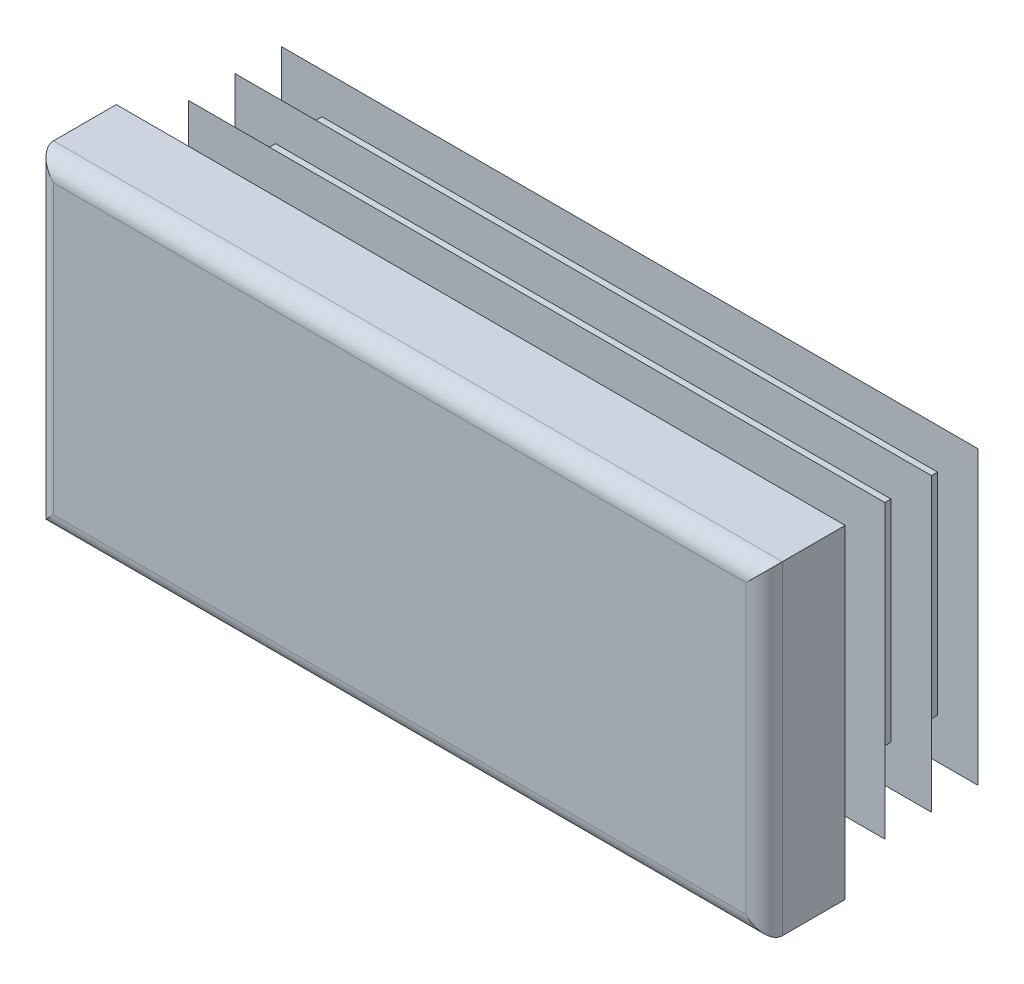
ISO-10303-21;
HEADER;
FILE_DESCRIPTION(('STEP AP214'),'2;1');
FILE_NAME('part.step','',(''),(''),'','','');
FILE_SCHEMA(('AUTOMOTIVE_DESIGN { 1 0 10303 214 1 1 1 1 }'));
ENDSEC;
DATA;
#1=APPLICATION_CONTEXT('core data for automotive mechanical design processes');
#2=APPLICATION_PROTOCOL_DEFINITION('international standard','automotive_design',2000,#1);
#3=PRODUCT_CONTEXT('',#1,'mechanical');
#4=PRODUCT('Part','Part','',(#3));
#5=PRODUCT_RELATED_PRODUCT_CATEGORY('part','',(#4));
#6=PRODUCT_DEFINITION_FORMATION('','',#4);
#7=PRODUCT_DEFINITION_CONTEXT('part definition',#1,'design');
#8=PRODUCT_DEFINITION('design','',#6,#7);
#9=PRODUCT_DEFINITION_SHAPE('','',#8);
#10=(LENGTH_UNIT() NAMED_UNIT(*) SI_UNIT(.MILLI.,.METRE.));
#11=(NAMED_UNIT(*) PLANE_ANGLE_UNIT() SI_UNIT($,.RADIAN.));
#12=(NAMED_UNIT(*) SI_UNIT($,.STERADIAN.) SOLID_ANGLE_UNIT());
#13=UNCERTAINTY_MEASURE_WITH_UNIT(LENGTH_MEASURE(1.E-05),#10,'distance_accuracy_value','');
#14=(GEOMETRIC_REPRESENTATION_CONTEXT(3) GLOBAL_UNCERTAINTY_ASSIGNED_CONTEXT((#13)) GLOBAL_UNIT_ASSIGNED_CONTEXT((#10,
#11,#12)) REPRESENTATION_CONTEXT('',''));
#15=CARTESIAN_POINT('',(0.,0.,0.));
#16=DIRECTION('',(0.,0.,1.));
#17=DIRECTION('',(1.,0.,0.));
#18=AXIS2_PLACEMENT_3D('',#15,#16,#17);
#19=CARTESIAN_POINT('',(21.375,-10.,5.));
#20=DIRECTION('',(0.,0.,-1.));
#21=DIRECTION('',(0.,1.,0.));
#22=AXIS2_PLACEMENT_3D('',#19,#20,#21);
#23=PLANE('',#22);
#24=DIRECTION('',(0.,1.,0.));
#25=VECTOR('',#24,1.);
#26=CARTESIAN_POINT('',(-21.375,-10.,5.));
#27=LINE('',#26,#25);
#28=CARTESIAN_POINT('',(-21.375,-8.875,5.));
#29=VERTEX_POINT('',#28);
#30=CARTESIAN_POINT('',(-21.375,8.875,5.));
#31=VERTEX_POINT('',#30);
#32=EDGE_CURVE('E310',#29,#31,#27,.T.);
#33=ORIENTED_EDGE('',*,*,#32,.F.);
#34=DIRECTION('',(-1.,0.,0.));
#35=VECTOR('',#34,1.);
#36=CARTESIAN_POINT('',(22.5,-8.875,5.));
#37=LINE('',#36,#35);
#38=CARTESIAN_POINT('',(21.375,-8.875,5.));
#39=VERTEX_POINT('',#38);
#40=EDGE_CURVE('E482',#39,#29,#37,.T.);
#41=ORIENTED_EDGE('',*,*,#40,.F.);
#42=DIRECTION('',(0.,1.,0.));
#43=VECTOR('',#42,1.);
#44=CARTESIAN_POINT('',(21.375,-10.,5.));
#45=LINE('',#44,#43);
#46=CARTESIAN_POINT('',(21.375,8.875,5.));
#47=VERTEX_POINT('',#46);
#48=EDGE_CURVE('E305',#39,#47,#45,.T.);
#49=ORIENTED_EDGE('',*,*,#48,.T.);
#50=DIRECTION('',(-1.,0.,0.));
#51=VECTOR('',#50,1.);
#52=CARTESIAN_POINT('',(22.5,8.875,5.));
#53=LINE('',#52,#51);
#54=EDGE_CURVE('E630',#47,#31,#53,.T.);
#55=ORIENTED_EDGE('',*,*,#54,.T.);
#56=EDGE_LOOP('',(#33,#41,#49,#55));
#57=FACE_BOUND('',#56,.T.);
#58=ADVANCED_FACE('F14',(#57),#23,.F.);
#59=CARTESIAN_POINT('',(-21.375,-10.,3.875));
#60=DIRECTION('',(0.,1.,0.));
#61=DIRECTION('',(-1.,0.,0.));
#62=AXIS2_PLACEMENT_3D('',#59,#60,#61);
#63=CYLINDRICAL_SURFACE('',#62,1.125);
#64=DIRECTION('',(0.,1.,0.));
#65=VECTOR('',#64,1.);
#66=CARTESIAN_POINT('',(-22.5,-10.,3.875));
#67=LINE('',#66,#65);
#68=CARTESIAN_POINT('',(-22.5,-10.,3.875));
#69=VERTEX_POINT('',#68);
#70=CARTESIAN_POINT('',(-22.5,10.,3.875));
#71=VERTEX_POINT('',#70);
#72=EDGE_CURVE('E402',#69,#71,#67,.T.);
#73=ORIENTED_EDGE('',*,*,#72,.F.);
#74=CARTESIAN_POINT('',(-21.375,-8.875,3.875));
#75=DIRECTION('',(-0.707106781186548,0.707106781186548,0.));
#76=DIRECTION('',(0.707106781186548,0.707106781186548,0.));
#77=AXIS2_PLACEMENT_3D('',#74,#75,#76);
#78=ELLIPSE('',#77,1.59099025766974,1.125);
#79=EDGE_CURVE('E59',#69,#29,#78,.T.);
#80=ORIENTED_EDGE('',*,*,#79,.T.);
#81=ORIENTED_EDGE('',*,*,#32,.T.);
#82=CARTESIAN_POINT('',(-21.375,8.875,3.875));
#83=DIRECTION('',(0.707106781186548,0.707106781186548,0.));
#84=DIRECTION('',(-0.707106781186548,0.707106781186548,0.));
#85=AXIS2_PLACEMENT_3D('',#82,#83,#84);
#86=ELLIPSE('',#85,1.59099025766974,1.125);
#87=EDGE_CURVE('E306',#31,#71,#86,.F.);
#88=ORIENTED_EDGE('',*,*,#87,.T.);
#89=EDGE_LOOP('',(#73,#80,#81,#88));
#90=FACE_BOUND('',#89,.T.);
#91=ADVANCED_FACE('F16',(#90),#63,.T.);
#92=CARTESIAN_POINT('',(-22.5,-10.,3.875));
#93=DIRECTION('',(1.,0.,0.));
#94=DIRECTION('',(0.,1.,0.));
#95=AXIS2_PLACEMENT_3D('',#92,#93,#94);
#96=PLANE('',#95);
#97=DIRECTION('',(0.,0.,-1.));
#98=VECTOR('',#97,1.);
#99=CARTESIAN_POINT('',(-22.5,10.,3.875));
#100=LINE('',#99,#98);
#101=CARTESIAN_POINT('',(-22.5,10.,0.));
#102=VERTEX_POINT('',#101);
#103=EDGE_CURVE('E615',#71,#102,#100,.T.);
#104=ORIENTED_EDGE('',*,*,#103,.T.);
#105=DIRECTION('',(0.,1.,0.));
#106=VECTOR('',#105,1.);
#107=CARTESIAN_POINT('',(-22.5,-10.,0.));
#108=LINE('',#107,#106);
#109=CARTESIAN_POINT('',(-22.5,-10.,0.));
#110=VERTEX_POINT('',#109);
#111=EDGE_CURVE('E400',#110,#102,#108,.T.);
#112=ORIENTED_EDGE('',*,*,#111,.F.);
#113=DIRECTION('',(0.,0.,-1.));
#114=VECTOR('',#113,1.);
#115=CARTESIAN_POINT('',(-22.5,-10.,3.875));
#116=LINE('',#115,#114);
#117=EDGE_CURVE('E616',#69,#110,#116,.T.);
#118=ORIENTED_EDGE('',*,*,#117,.F.);
#119=ORIENTED_EDGE('',*,*,#72,.T.);
#120=EDGE_LOOP('',(#104,#112,#118,#119));
#121=FACE_BOUND('',#120,.T.);
#122=ADVANCED_FACE('F697',(#121),#96,.F.);
#123=CARTESIAN_POINT('',(-19.,-10.,0.));
#124=DIRECTION('',(1.,0.,0.));
#125=DIRECTION('',(0.,1.,0.));
#126=AXIS2_PLACEMENT_3D('',#123,#124,#125);
#127=PLANE('',#126);
#128=DIRECTION('',(0.,1.,0.));
#129=VECTOR('',#128,1.);
#130=CARTESIAN_POINT('',(-19.,-10.,0.));
#131=LINE('',#130,#129);
#132=CARTESIAN_POINT('',(-19.,-6.5,0.));
#133=VERTEX_POINT('',#132);
#134=CARTESIAN_POINT('',(-19.,6.5,0.));
#135=VERTEX_POINT('',#134);
#136=EDGE_CURVE('E397',#133,#135,#131,.T.);
#137=ORIENTED_EDGE('',*,*,#136,.T.);
#138=DIRECTION('',(0.,0.,-1.));
#139=VECTOR('',#138,1.);
#140=CARTESIAN_POINT('',(-19.,6.5,0.));
#141=LINE('',#140,#139);
#142=CARTESIAN_POINT('',(-19.,6.5,-0.575));
#143=VERTEX_POINT('',#142);
#144=EDGE_CURVE('E495',#135,#143,#141,.T.);
#145=ORIENTED_EDGE('',*,*,#144,.T.);
#146=DIRECTION('',(0.,1.,0.));
#147=VECTOR('',#146,1.);
#148=CARTESIAN_POINT('',(-19.,-10.,-0.575));
#149=LINE('',#148,#147);
#150=CARTESIAN_POINT('',(-19.,-6.5,-0.575));
#151=VERTEX_POINT('',#150);
#152=EDGE_CURVE('E394',#151,#143,#149,.T.);
#153=ORIENTED_EDGE('',*,*,#152,.F.);
#154=DIRECTION('',(0.,0.,1.));
#155=VECTOR('',#154,1.);
#156=CARTESIAN_POINT('',(-19.,-6.5,0.));
#157=LINE('',#156,#155);
#158=EDGE_CURVE('E489',#151,#133,#157,.T.);
#159=ORIENTED_EDGE('',*,*,#158,.T.);
#160=EDGE_LOOP('',(#137,#145,#153,#159));
#161=FACE_BOUND('',#160,.T.);
#162=ADVANCED_FACE('F787',(#161),#127,.F.);
#163=CARTESIAN_POINT('',(-21.5,-10.,-0.575));
#164=DIRECTION('',(0.342020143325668,0.,0.939692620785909));
#165=DIRECTION('',(-0.939692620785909,0.,0.342020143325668));
#166=AXIS2_PLACEMENT_3D('',#163,#164,#165);
#167=PLANE('',#166);
#168=DIRECTION('',(0.,1.,0.));
#169=VECTOR('',#168,1.);
#170=CARTESIAN_POINT('',(-21.5,-10.,-0.575));
#171=LINE('',#170,#169);
#172=CARTESIAN_POINT('',(-21.5,-9.,-0.575));
#173=VERTEX_POINT('',#172);
#174=CARTESIAN_POINT('',(-21.5,9.,-0.575000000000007));
#175=VERTEX_POINT('',#174);
#176=EDGE_CURVE('E392',#173,#175,#171,.T.);
#177=ORIENTED_EDGE('',*,*,#176,.T.);
#178=DIRECTION('',(0.844349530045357,-0.438895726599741,-0.307318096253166));
#179=VECTOR('',#178,1.);
#180=CARTESIAN_POINT('',(-14.4589533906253,5.34004028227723,-3.13773138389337));
#181=LINE('',#180,#179);
#182=CARTESIAN_POINT('',(-19.,7.70049158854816,-1.48492558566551));
#183=VERTEX_POINT('',#182);
#184=EDGE_CURVE('E519',#175,#183,#181,.T.);
#185=ORIENTED_EDGE('',*,*,#184,.T.);
#186=DIRECTION('',(0.,1.,0.));
#187=VECTOR('',#186,1.);
#188=CARTESIAN_POINT('',(-19.,-10.,-1.48492558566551));
#189=LINE('',#188,#187);
#190=CARTESIAN_POINT('',(-19.,-7.70049158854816,-1.48492558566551));
#191=VERTEX_POINT('',#190);
#192=EDGE_CURVE('E389',#191,#183,#189,.T.);
#193=ORIENTED_EDGE('',*,*,#192,.F.);
#194=DIRECTION('',(-0.844349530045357,-0.43889572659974,0.307318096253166));
#195=VECTOR('',#194,1.);
#196=CARTESIAN_POINT('',(-21.8705814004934,-9.19262945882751,-0.440119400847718));
#197=LINE('',#196,#195);
#198=EDGE_CURVE('E507',#191,#173,#197,.T.);
#199=ORIENTED_EDGE('',*,*,#198,.T.);
#200=EDGE_LOOP('',(#177,#185,#193,#199));
#201=FACE_BOUND('',#200,.T.);
#202=ADVANCED_FACE('F783',(#201),#167,.F.);
#203=CARTESIAN_POINT('',(-19.,-10.,-1.48492558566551));
#204=DIRECTION('',(1.,0.,0.));
#205=DIRECTION('',(0.,1.,0.));
#206=AXIS2_PLACEMENT_3D('',#203,#204,#205);
#207=PLANE('',#206);
#208=ORIENTED_EDGE('',*,*,#192,.T.);
#209=DIRECTION('',(0.,-0.819152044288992,-0.573576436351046));
#210=VECTOR('',#209,1.);
#211=CARTESIAN_POINT('',(-19.,-4.17671654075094,-9.80143625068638));
#212=LINE('',#211,#210);
#213=CARTESIAN_POINT('',(-19.,6.5,-2.32551884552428));
#214=VERTEX_POINT('',#213);
#215=EDGE_CURVE('E516',#183,#214,#212,.T.);
#216=ORIENTED_EDGE('',*,*,#215,.T.);
#217=DIRECTION('',(0.,0.,-1.));
#218=VECTOR('',#217,1.);
#219=CARTESIAN_POINT('',(-19.,6.5,-1.48492558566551));
#220=LINE('',#219,#218);
#221=CARTESIAN_POINT('',(-19.,6.5,-3.45));
#222=VERTEX_POINT('',#221);
#223=EDGE_CURVE('E525',#214,#222,#220,.T.);
#224=ORIENTED_EDGE('',*,*,#223,.T.);
#225=DIRECTION('',(0.,1.,0.));
#226=VECTOR('',#225,1.);
#227=CARTESIAN_POINT('',(-19.,-10.,-3.45));
#228=LINE('',#227,#226);
#229=CARTESIAN_POINT('',(-19.,-6.5,-3.45));
#230=VERTEX_POINT('',#229);
#231=EDGE_CURVE('E386',#230,#222,#228,.T.);
#232=ORIENTED_EDGE('',*,*,#231,.F.);
#233=DIRECTION('',(0.,0.,1.));
#234=VECTOR('',#233,1.);
#235=CARTESIAN_POINT('',(-19.,-6.5,-1.48492558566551));
#236=LINE('',#235,#234);
#237=CARTESIAN_POINT('',(-19.,-6.5,-2.32551884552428));
#238=VERTEX_POINT('',#237);
#239=EDGE_CURVE('E522',#230,#238,#236,.T.);
#240=ORIENTED_EDGE('',*,*,#239,.T.);
#241=DIRECTION('',(0.,-0.819152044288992,0.573576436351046));
#242=VECTOR('',#241,1.);
#243=CARTESIAN_POINT('',(-19.,-9.24348489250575,-0.404510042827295));
#244=LINE('',#243,#242);
#245=EDGE_CURVE('E504',#238,#191,#244,.T.);
#246=ORIENTED_EDGE('',*,*,#245,.T.);
#247=EDGE_LOOP('',(#208,#216,#224,#232,#240,#246));
#248=FACE_BOUND('',#247,.T.);
#249=ADVANCED_FACE('F779',(#248),#207,.F.);
#250=CARTESIAN_POINT('',(-21.5,-10.,-3.45));
#251=DIRECTION('',(0.342020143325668,0.,0.939692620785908));
#252=DIRECTION('',(-0.939692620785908,0.,0.342020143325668));
#253=AXIS2_PLACEMENT_3D('',#250,#251,#252);
#254=PLANE('',#253);
#255=DIRECTION('',(0.,1.,0.));
#256=VECTOR('',#255,1.);
#257=CARTESIAN_POINT('',(-21.5,-10.,-3.45));
#258=LINE('',#257,#256);
#259=CARTESIAN_POINT('',(-21.5,-9.,-3.45));
#260=VERTEX_POINT('',#259);
#261=CARTESIAN_POINT('',(-21.5,9.,-3.45));
#262=VERTEX_POINT('',#261);
#263=EDGE_CURVE('E384',#260,#262,#258,.T.);
#264=ORIENTED_EDGE('',*,*,#263,.T.);
#265=DIRECTION('',(0.844349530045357,-0.43889572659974,-0.307318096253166));
#266=VECTOR('',#265,1.);
#267=CARTESIAN_POINT('',(-14.4589533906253,5.34004028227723,-6.01273138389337));
#268=LINE('',#267,#266);
#269=CARTESIAN_POINT('',(-19.,7.70049158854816,-4.35992558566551));
#270=VERTEX_POINT('',#269);
#271=EDGE_CURVE('E549',#262,#270,#268,.T.);
#272=ORIENTED_EDGE('',*,*,#271,.T.);
#273=DIRECTION('',(0.,1.,0.));
#274=VECTOR('',#273,1.);
#275=CARTESIAN_POINT('',(-19.,-10.,-4.35992558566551));
#276=LINE('',#275,#274);
#277=CARTESIAN_POINT('',(-19.,-7.70049158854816,-4.35992558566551));
#278=VERTEX_POINT('',#277);
#279=EDGE_CURVE('E381',#278,#270,#276,.T.);
#280=ORIENTED_EDGE('',*,*,#279,.F.);
#281=DIRECTION('',(-0.844349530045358,-0.438895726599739,0.307318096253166));
#282=VECTOR('',#281,1.);
#283=CARTESIAN_POINT('',(-21.8705814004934,-9.19262945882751,-3.31511940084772));
#284=LINE('',#283,#282);
#285=EDGE_CURVE('E537',#278,#260,#284,.T.);
#286=ORIENTED_EDGE('',*,*,#285,.T.);
#287=EDGE_LOOP('',(#264,#272,#280,#286));
#288=FACE_BOUND('',#287,.T.);
#289=ADVANCED_FACE('F775',(#288),#254,.F.);
#290=CARTESIAN_POINT('',(-19.,-10.,-4.35992558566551));
#291=DIRECTION('',(1.,0.,0.));
#292=DIRECTION('',(0.,1.,0.));
#293=AXIS2_PLACEMENT_3D('',#290,#291,#292);
#294=PLANE('',#293);
#295=ORIENTED_EDGE('',*,*,#279,.T.);
#296=DIRECTION('',(0.,-0.819152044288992,-0.573576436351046));
#297=VECTOR('',#296,1.);
#298=CARTESIAN_POINT('',(-19.,-4.17671654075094,-12.6764362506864));
#299=LINE('',#298,#297);
#300=CARTESIAN_POINT('',(-19.,6.5,-5.20051884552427));
#301=VERTEX_POINT('',#300);
#302=EDGE_CURVE('E546',#270,#301,#299,.T.);
#303=ORIENTED_EDGE('',*,*,#302,.T.);
#304=DIRECTION('',(0.,0.,-1.));
#305=VECTOR('',#304,1.);
#306=CARTESIAN_POINT('',(-19.,6.5,-4.35992558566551));
#307=LINE('',#306,#305);
#308=CARTESIAN_POINT('',(-19.,6.5,-6.325));
#309=VERTEX_POINT('',#308);
#310=EDGE_CURVE('E555',#301,#309,#307,.T.);
#311=ORIENTED_EDGE('',*,*,#310,.T.);
#312=DIRECTION('',(0.,1.,0.));
#313=VECTOR('',#312,1.);
#314=CARTESIAN_POINT('',(-19.,-10.,-6.325));
#315=LINE('',#314,#313);
#316=CARTESIAN_POINT('',(-19.,-6.5,-6.325));
#317=VERTEX_POINT('',#316);
#318=EDGE_CURVE('E378',#317,#309,#315,.T.);
#319=ORIENTED_EDGE('',*,*,#318,.F.);
#320=DIRECTION('',(0.,0.,1.));
#321=VECTOR('',#320,1.);
#322=CARTESIAN_POINT('',(-19.,-6.5,-4.35992558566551));
#323=LINE('',#322,#321);
#324=CARTESIAN_POINT('',(-19.,-6.5,-5.20051884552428));
#325=VERTEX_POINT('',#324);
#326=EDGE_CURVE('E552',#317,#325,#323,.T.);
#327=ORIENTED_EDGE('',*,*,#326,.T.);
#328=DIRECTION('',(0.,-0.819152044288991,0.573576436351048));
#329=VECTOR('',#328,1.);
#330=CARTESIAN_POINT('',(-19.,-9.24348489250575,-3.27951004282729));
#331=LINE('',#330,#329);
#332=EDGE_CURVE('E534',#325,#278,#331,.T.);
#333=ORIENTED_EDGE('',*,*,#332,.T.);
#334=EDGE_LOOP('',(#295,#303,#311,#319,#327,#333));
#335=FACE_BOUND('',#334,.T.);
#336=ADVANCED_FACE('F771',(#335),#294,.F.);
#337=CARTESIAN_POINT('',(-21.5,-10.,-6.325));
#338=DIRECTION('',(0.342020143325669,0.,0.939692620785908));
#339=DIRECTION('',(-0.939692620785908,0.,0.342020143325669));
#340=AXIS2_PLACEMENT_3D('',#337,#338,#339);
#341=PLANE('',#340);
#342=DIRECTION('',(0.,1.,0.));
#343=VECTOR('',#342,1.);
#344=CARTESIAN_POINT('',(-21.5,-10.,-6.325));
#345=LINE('',#344,#343);
#346=CARTESIAN_POINT('',(-21.5,-9.,-6.325));
#347=VERTEX_POINT('',#346);
#348=CARTESIAN_POINT('',(-21.5,9.,-6.325));
#349=VERTEX_POINT('',#348);
#350=EDGE_CURVE('E376',#347,#349,#345,.T.);
#351=ORIENTED_EDGE('',*,*,#350,.T.);
#352=DIRECTION('',(0.844349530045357,-0.438895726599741,-0.307318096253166));
#353=VECTOR('',#352,1.);
#354=CARTESIAN_POINT('',(-14.4589533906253,5.34004028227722,-8.88773138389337));
#355=LINE('',#354,#353);
#356=CARTESIAN_POINT('',(-19.,7.70049158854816,-7.2349255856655));
#357=VERTEX_POINT('',#356);
#358=EDGE_CURVE('E579',#349,#357,#355,.T.);
#359=ORIENTED_EDGE('',*,*,#358,.T.);
#360=DIRECTION('',(0.,1.,0.));
#361=VECTOR('',#360,1.);
#362=CARTESIAN_POINT('',(-19.,-10.,-7.2349255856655));
#363=LINE('',#362,#361);
#364=CARTESIAN_POINT('',(-19.,-7.70049158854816,-7.2349255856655));
#365=VERTEX_POINT('',#364);
#366=EDGE_CURVE('E373',#365,#357,#363,.T.);
#367=ORIENTED_EDGE('',*,*,#366,.F.);
#368=DIRECTION('',(-0.844349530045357,-0.43889572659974,0.307318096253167));
#369=VECTOR('',#368,1.);
#370=CARTESIAN_POINT('',(-21.8705814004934,-9.19262945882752,-6.19011940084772));
#371=LINE('',#370,#369);
#372=EDGE_CURVE('E567',#365,#347,#371,.T.);
#373=ORIENTED_EDGE('',*,*,#372,.T.);
#374=EDGE_LOOP('',(#351,#359,#367,#373));
#375=FACE_BOUND('',#374,.T.);
#376=ADVANCED_FACE('F767',(#375),#341,.F.);
#377=CARTESIAN_POINT('',(-19.,-10.,-7.2349255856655));
#378=DIRECTION('',(1.,0.,0.));
#379=DIRECTION('',(0.,1.,0.));
#380=AXIS2_PLACEMENT_3D('',#377,#378,#379);
#381=PLANE('',#380);
#382=ORIENTED_EDGE('',*,*,#366,.T.);
#383=DIRECTION('',(0.,-0.819152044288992,-0.573576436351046));
#384=VECTOR('',#383,1.);
#385=CARTESIAN_POINT('',(-19.,-4.17671654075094,-15.5514362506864));
#386=LINE('',#385,#384);
#387=CARTESIAN_POINT('',(-19.,6.5,-8.07551884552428));
#388=VERTEX_POINT('',#387);
#389=EDGE_CURVE('E576',#357,#388,#386,.T.);
#390=ORIENTED_EDGE('',*,*,#389,.T.);
#391=DIRECTION('',(0.,0.,-1.));
#392=VECTOR('',#391,1.);
#393=CARTESIAN_POINT('',(-19.,6.5,-7.2349255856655));
#394=LINE('',#393,#392);
#395=CARTESIAN_POINT('',(-19.,6.5,-9.2));
#396=VERTEX_POINT('',#395);
#397=EDGE_CURVE('E585',#388,#396,#394,.T.);
#398=ORIENTED_EDGE('',*,*,#397,.T.);
#399=DIRECTION('',(0.,1.,0.));
#400=VECTOR('',#399,1.);
#401=CARTESIAN_POINT('',(-19.,-10.,-9.2));
#402=LINE('',#401,#400);
#403=CARTESIAN_POINT('',(-19.,-6.5,-9.2));
#404=VERTEX_POINT('',#403);
#405=EDGE_CURVE('E370',#404,#396,#402,.T.);
#406=ORIENTED_EDGE('',*,*,#405,.F.);
#407=DIRECTION('',(0.,0.,1.));
#408=VECTOR('',#407,1.);
#409=CARTESIAN_POINT('',(-19.,-6.5,-7.2349255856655));
#410=LINE('',#409,#408);
#411=CARTESIAN_POINT('',(-19.,-6.5,-8.07551884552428));
#412=VERTEX_POINT('',#411);
#413=EDGE_CURVE('E582',#404,#412,#410,.T.);
#414=ORIENTED_EDGE('',*,*,#413,.T.);
#415=DIRECTION('',(0.,-0.819152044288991,0.573576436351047));
#416=VECTOR('',#415,1.);
#417=CARTESIAN_POINT('',(-19.,-9.24348489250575,-6.15451004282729));
#418=LINE('',#417,#416);
#419=EDGE_CURVE('E564',#412,#365,#418,.T.);
#420=ORIENTED_EDGE('',*,*,#419,.T.);
#421=EDGE_LOOP('',(#382,#390,#398,#406,#414,#420));
#422=FACE_BOUND('',#421,.T.);
#423=ADVANCED_FACE('F764',(#422),#381,.F.);
#424=CARTESIAN_POINT('',(-21.5,-10.,-9.2));
#425=DIRECTION('',(0.342020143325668,0.,0.939692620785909));
#426=DIRECTION('',(-0.939692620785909,0.,0.342020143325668));
#427=AXIS2_PLACEMENT_3D('',#424,#425,#426);
#428=PLANE('',#427);
#429=DIRECTION('',(0.,1.,0.));
#430=VECTOR('',#429,1.);
#431=CARTESIAN_POINT('',(-21.5,-10.,-9.2));
#432=LINE('',#431,#430);
#433=CARTESIAN_POINT('',(-21.5,-9.,-9.2));
#434=VERTEX_POINT('',#433);
#435=CARTESIAN_POINT('',(-21.5,9.,-9.2));
#436=VERTEX_POINT('',#435);
#437=EDGE_CURVE('E368',#434,#436,#432,.T.);
#438=ORIENTED_EDGE('',*,*,#437,.T.);
#439=DIRECTION('',(0.844349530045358,-0.43889572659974,-0.307318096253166));
#440=VECTOR('',#439,1.);
#441=CARTESIAN_POINT('',(-14.4589533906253,5.34004028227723,-11.7627313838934));
#442=LINE('',#441,#440);
#443=CARTESIAN_POINT('',(-19.,7.70049158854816,-10.1099255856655));
#444=VERTEX_POINT('',#443);
#445=EDGE_CURVE('E607',#436,#444,#442,.T.);
#446=ORIENTED_EDGE('',*,*,#445,.T.);
#447=DIRECTION('',(0.,1.,0.));
#448=VECTOR('',#447,1.);
#449=CARTESIAN_POINT('',(-19.,-10.,-10.1099255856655));
#450=LINE('',#449,#448);
#451=CARTESIAN_POINT('',(-19.,-7.70049158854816,-10.1099255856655));
#452=VERTEX_POINT('',#451);
#453=EDGE_CURVE('E365',#452,#444,#450,.T.);
#454=ORIENTED_EDGE('',*,*,#453,.F.);
#455=DIRECTION('',(-0.844349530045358,-0.43889572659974,0.307318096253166));
#456=VECTOR('',#455,1.);
#457=CARTESIAN_POINT('',(-21.8705814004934,-9.19262945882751,-9.06511940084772));
#458=LINE('',#457,#456);
#459=EDGE_CURVE('E595',#452,#434,#458,.T.);
#460=ORIENTED_EDGE('',*,*,#459,.T.);
#461=EDGE_LOOP('',(#438,#446,#454,#460));
#462=FACE_BOUND('',#461,.T.);
#463=ADVANCED_FACE('F675',(#462),#428,.F.);
#464=CARTESIAN_POINT('',(-19.,-10.,-10.1099255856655));
#465=DIRECTION('',(1.,0.,0.));
#466=DIRECTION('',(0.,1.,0.));
#467=AXIS2_PLACEMENT_3D('',#464,#465,#466);
#468=PLANE('',#467);
#469=ORIENTED_EDGE('',*,*,#453,.T.);
#470=DIRECTION('',(0.,-0.819152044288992,-0.573576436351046));
#471=VECTOR('',#470,1.);
#472=CARTESIAN_POINT('',(-19.,-4.17671654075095,-18.4264362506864));
#473=LINE('',#472,#471);
#474=CARTESIAN_POINT('',(-19.,6.5,-10.9505188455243));
#475=VERTEX_POINT('',#474);
#476=EDGE_CURVE('E604',#444,#475,#473,.T.);
#477=ORIENTED_EDGE('',*,*,#476,.T.);
#478=DIRECTION('',(0.,0.,-1.));
#479=VECTOR('',#478,1.);
#480=CARTESIAN_POINT('',(-19.,6.5,-10.1099255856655));
#481=LINE('',#480,#479);
#482=CARTESIAN_POINT('',(-19.,6.5,-11.5));
#483=VERTEX_POINT('',#482);
#484=EDGE_CURVE('E613',#475,#483,#481,.T.);
#485=ORIENTED_EDGE('',*,*,#484,.T.);
#486=DIRECTION('',(0.,1.,0.));
#487=VECTOR('',#486,1.);
#488=CARTESIAN_POINT('',(-19.,-10.,-11.5));
#489=LINE('',#488,#487);
#490=CARTESIAN_POINT('',(-19.,-6.5,-11.5));
#491=VERTEX_POINT('',#490);
#492=EDGE_CURVE('E362',#491,#483,#489,.T.);
#493=ORIENTED_EDGE('',*,*,#492,.F.);
#494=DIRECTION('',(0.,0.,1.));
#495=VECTOR('',#494,1.);
#496=CARTESIAN_POINT('',(-19.,-6.5,-10.1099255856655));
#497=LINE('',#496,#495);
#498=CARTESIAN_POINT('',(-19.,-6.5,-10.9505188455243));
#499=VERTEX_POINT('',#498);
#500=EDGE_CURVE('E610',#491,#499,#497,.T.);
#501=ORIENTED_EDGE('',*,*,#500,.T.);
#502=DIRECTION('',(0.,-0.819152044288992,0.573576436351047));
#503=VECTOR('',#502,1.);
#504=CARTESIAN_POINT('',(-19.,-9.24348489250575,-9.02951004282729));
#505=LINE('',#504,#503);
#506=EDGE_CURVE('E592',#499,#452,#505,.T.);
#507=ORIENTED_EDGE('',*,*,#506,.T.);
#508=EDGE_LOOP('',(#469,#477,#485,#493,#501,#507));
#509=FACE_BOUND('',#508,.T.);
#510=ADVANCED_FACE('F677',(#509),#468,.F.);
#511=CARTESIAN_POINT('',(-19.,-10.,-11.5));
#512=DIRECTION('',(0.,0.,1.));
#513=DIRECTION('',(0.,-1.,0.));
#514=AXIS2_PLACEMENT_3D('',#511,#512,#513);
#515=PLANE('',#514);
#516=ORIENTED_EDGE('',*,*,#492,.T.);
#517=DIRECTION('',(-1.,0.,0.));
#518=VECTOR('',#517,1.);
#519=CARTESIAN_POINT('',(22.5,6.5,-11.5));
#520=LINE('',#519,#518);
#521=CARTESIAN_POINT('',(19.,6.5,-11.5));
#522=VERTEX_POINT('',#521);
#523=EDGE_CURVE('E438',#522,#483,#520,.T.);
#524=ORIENTED_EDGE('',*,*,#523,.F.);
#525=DIRECTION('',(0.,1.,0.));
#526=VECTOR('',#525,1.);
#527=CARTESIAN_POINT('',(19.,-10.,-11.5));
#528=LINE('',#527,#526);
#529=CARTESIAN_POINT('',(19.,-6.5,-11.5));
#530=VERTEX_POINT('',#529);
#531=EDGE_CURVE('E359',#530,#522,#528,.T.);
#532=ORIENTED_EDGE('',*,*,#531,.F.);
#533=DIRECTION('',(-1.,0.,0.));
#534=VECTOR('',#533,1.);
#535=CARTESIAN_POINT('',(22.5,-6.5,-11.5));
#536=LINE('',#535,#534);
#537=EDGE_CURVE('E436',#530,#491,#536,.T.);
#538=ORIENTED_EDGE('',*,*,#537,.T.);
#539=EDGE_LOOP('',(#516,#524,#532,#538));
#540=FACE_BOUND('',#539,.T.);
#541=ADVANCED_FACE('F435',(#540),#515,.F.);
#542=CARTESIAN_POINT('',(19.,-10.,-11.5));
#543=DIRECTION('',(-1.,0.,0.));
#544=DIRECTION('',(0.,-1.,0.));
#545=AXIS2_PLACEMENT_3D('',#542,#543,#544);
#546=PLANE('',#545);
#547=DIRECTION('',(0.,0.,1.));
#548=VECTOR('',#547,1.);
#549=CARTESIAN_POINT('',(19.,6.5,-11.5));
#550=LINE('',#549,#548);
#551=CARTESIAN_POINT('',(19.,6.5,-10.9505188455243));
#552=VERTEX_POINT('',#551);
#553=EDGE_CURVE('E9',#522,#552,#550,.T.);
#554=ORIENTED_EDGE('',*,*,#553,.T.);
#555=DIRECTION('',(0.,0.819152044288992,0.573576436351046));
#556=VECTOR('',#555,1.);
#557=CARTESIAN_POINT('',(19.,-4.82983787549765,-18.8837567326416));
#558=LINE('',#557,#556);
#559=CARTESIAN_POINT('',(19.,7.70049158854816,-10.1099255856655));
#560=VERTEX_POINT('',#559);
#561=EDGE_CURVE('E601',#552,#560,#558,.T.);
#562=ORIENTED_EDGE('',*,*,#561,.T.);
#563=DIRECTION('',(0.,1.,0.));
#564=VECTOR('',#563,1.);
#565=CARTESIAN_POINT('',(19.,-10.,-10.1099255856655));
#566=LINE('',#565,#564);
#567=CARTESIAN_POINT('',(19.,-7.70049158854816,-10.1099255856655));
#568=VERTEX_POINT('',#567);
#569=EDGE_CURVE('E356',#568,#560,#566,.T.);
#570=ORIENTED_EDGE('',*,*,#569,.F.);
#571=DIRECTION('',(0.,0.819152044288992,-0.573576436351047));
#572=VECTOR('',#571,1.);
#573=CARTESIAN_POINT('',(19.,-8.59036355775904,-9.48683052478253));
#574=LINE('',#573,#572);
#575=CARTESIAN_POINT('',(19.,-6.5,-10.9505188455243));
#576=VERTEX_POINT('',#575);
#577=EDGE_CURVE('E428',#568,#576,#574,.T.);
#578=ORIENTED_EDGE('',*,*,#577,.T.);
#579=DIRECTION('',(0.,0.,-1.));
#580=VECTOR('',#579,1.);
#581=CARTESIAN_POINT('',(19.,-6.5,-11.5));
#582=LINE('',#581,#580);
#583=EDGE_CURVE('E23',#576,#530,#582,.T.);
#584=ORIENTED_EDGE('',*,*,#583,.T.);
#585=ORIENTED_EDGE('',*,*,#531,.T.);
#586=EDGE_LOOP('',(#554,#562,#570,#578,#584,#585));
#587=FACE_BOUND('',#586,.T.);
#588=ADVANCED_FACE('F426',(#587),#546,.F.);
#589=CARTESIAN_POINT('',(19.,-10.,-10.1099255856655));
#590=DIRECTION('',(-0.342020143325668,0.,0.939692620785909));
#591=DIRECTION('',(-0.939692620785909,0.,-0.342020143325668));
#592=AXIS2_PLACEMENT_3D('',#589,#590,#591);
#593=PLANE('',#592);
#594=ORIENTED_EDGE('',*,*,#569,.T.);
#595=DIRECTION('',(0.844349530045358,0.43889572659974,0.307318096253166));
#596=VECTOR('',#595,1.);
#597=CARTESIAN_POINT('',(12.4405270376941,4.29085547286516,-12.4973784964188));
#598=LINE('',#597,#596);
#599=CARTESIAN_POINT('',(21.5,9.,-9.2));
#600=VERTEX_POINT('',#599);
#601=EDGE_CURVE('E598',#560,#600,#598,.T.);
#602=ORIENTED_EDGE('',*,*,#601,.T.);
#603=DIRECTION('',(0.,1.,0.));
#604=VECTOR('',#603,1.);
#605=CARTESIAN_POINT('',(21.5,-10.,-9.2));
#606=LINE('',#605,#604);
#607=CARTESIAN_POINT('',(21.5,-9.,-9.2));
#608=VERTEX_POINT('',#607);
#609=EDGE_CURVE('E353',#608,#600,#606,.T.);
#610=ORIENTED_EDGE('',*,*,#609,.F.);
#611=DIRECTION('',(-0.844349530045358,0.43889572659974,-0.307318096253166));
#612=VECTOR('',#611,1.);
#613=CARTESIAN_POINT('',(19.8521550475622,-8.14344464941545,-9.79976651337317));
#614=LINE('',#613,#612);
#615=EDGE_CURVE('E588',#608,#568,#614,.T.);
#616=ORIENTED_EDGE('',*,*,#615,.T.);
#617=EDGE_LOOP('',(#594,#602,#610,#616));
#618=FACE_BOUND('',#617,.T.);
#619=ADVANCED_FACE('F752',(#618),#593,.F.);
#620=CARTESIAN_POINT('',(21.5,-10.,-9.2));
#621=DIRECTION('',(0.,0.,-1.));
#622=DIRECTION('',(0.,1.,0.));
#623=AXIS2_PLACEMENT_3D('',#620,#621,#622);
#624=PLANE('',#623);
#625=ORIENTED_EDGE('',*,*,#609,.T.);
#626=DIRECTION('',(-1.,0.,0.));
#627=VECTOR('',#626,1.);
#628=CARTESIAN_POINT('',(22.5,9.,-9.2));
#629=LINE('',#628,#627);
#630=EDGE_CURVE('E444',#600,#436,#629,.T.);
#631=ORIENTED_EDGE('',*,*,#630,.T.);
#632=ORIENTED_EDGE('',*,*,#437,.F.);
#633=DIRECTION('',(-1.,0.,0.));
#634=VECTOR('',#633,1.);
#635=CARTESIAN_POINT('',(22.5,-9.,-9.2));
#636=LINE('',#635,#634);
#637=EDGE_CURVE('E451',#608,#434,#636,.T.);
#638=ORIENTED_EDGE('',*,*,#637,.F.);
#639=EDGE_LOOP('',(#625,#631,#632,#638));
#640=FACE_BOUND('',#639,.T.);
#641=ORIENTED_EDGE('',*,*,#405,.T.);
#642=DIRECTION('',(-1.,0.,0.));
#643=VECTOR('',#642,1.);
#644=CARTESIAN_POINT('',(22.5,6.5,-9.2));
#645=LINE('',#644,#643);
#646=CARTESIAN_POINT('',(19.,6.5,-9.2));
#647=VERTEX_POINT('',#646);
#648=EDGE_CURVE('E663',#647,#396,#645,.T.);
#649=ORIENTED_EDGE('',*,*,#648,.F.);
#650=DIRECTION('',(0.,1.,0.));
#651=VECTOR('',#650,1.);
#652=CARTESIAN_POINT('',(19.,-10.,-9.2));
#653=LINE('',#652,#651);
#654=CARTESIAN_POINT('',(19.,-6.5,-9.2));
#655=VERTEX_POINT('',#654);
#656=EDGE_CURVE('E350',#655,#647,#653,.T.);
#657=ORIENTED_EDGE('',*,*,#656,.F.);
#658=DIRECTION('',(-1.,0.,0.));
#659=VECTOR('',#658,1.);
#660=CARTESIAN_POINT('',(22.5,-6.5,-9.2));
#661=LINE('',#660,#659);
#662=EDGE_CURVE('E453',#655,#404,#661,.T.);
#663=ORIENTED_EDGE('',*,*,#662,.T.);
#664=EDGE_LOOP('',(#641,#649,#657,#663));
#665=FACE_BOUND('',#664,.T.);
#666=ADVANCED_FACE('F667',(#640,#665),#624,.F.);
#667=CARTESIAN_POINT('',(19.,-10.,-9.2));
#668=DIRECTION('',(-1.,0.,0.));
#669=DIRECTION('',(0.,-1.,0.));
#670=AXIS2_PLACEMENT_3D('',#667,#668,#669);
#671=PLANE('',#670);
#672=DIRECTION('',(0.,0.,1.));
#673=VECTOR('',#672,1.);
#674=CARTESIAN_POINT('',(19.,6.5,-9.2));
#675=LINE('',#674,#673);
#676=CARTESIAN_POINT('',(19.,6.5,-8.07551884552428));
#677=VERTEX_POINT('',#676);
#678=EDGE_CURVE('E420',#647,#677,#675,.T.);
#679=ORIENTED_EDGE('',*,*,#678,.T.);
#680=DIRECTION('',(0.,0.819152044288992,0.573576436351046));
#681=VECTOR('',#680,1.);
#682=CARTESIAN_POINT('',(19.,-5.0999995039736,-16.1979259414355));
#683=LINE('',#682,#681);
#684=CARTESIAN_POINT('',(19.,7.70049158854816,-7.2349255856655));
#685=VERTEX_POINT('',#684);
#686=EDGE_CURVE('E573',#677,#685,#683,.T.);
#687=ORIENTED_EDGE('',*,*,#686,.T.);
#688=DIRECTION('',(0.,1.,0.));
#689=VECTOR('',#688,1.);
#690=CARTESIAN_POINT('',(19.,-10.,-7.2349255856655));
#691=LINE('',#690,#689);
#692=CARTESIAN_POINT('',(19.,-7.70049158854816,-7.23492558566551));
#693=VERTEX_POINT('',#692);
#694=EDGE_CURVE('E347',#693,#685,#691,.T.);
#695=ORIENTED_EDGE('',*,*,#694,.F.);
#696=DIRECTION('',(0.,0.819152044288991,-0.573576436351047));
#697=VECTOR('',#696,1.);
#698=CARTESIAN_POINT('',(19.,-8.32020192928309,-6.8009997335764));
#699=LINE('',#698,#697);
#700=CARTESIAN_POINT('',(19.,-6.5,-8.07551884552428));
#701=VERTEX_POINT('',#700);
#702=EDGE_CURVE('E561',#693,#701,#699,.T.);
#703=ORIENTED_EDGE('',*,*,#702,.T.);
#704=DIRECTION('',(0.,0.,-1.));
#705=VECTOR('',#704,1.);
#706=CARTESIAN_POINT('',(19.,-6.5,-9.2));
#707=LINE('',#706,#705);
#708=EDGE_CURVE('E417',#701,#655,#707,.T.);
#709=ORIENTED_EDGE('',*,*,#708,.T.);
#710=ORIENTED_EDGE('',*,*,#656,.T.);
#711=EDGE_LOOP('',(#679,#687,#695,#703,#709,#710));
#712=FACE_BOUND('',#711,.T.);
#713=ADVANCED_FACE('F745',(#712),#671,.F.);
#714=CARTESIAN_POINT('',(19.,-10.,-7.2349255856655));
#715=DIRECTION('',(-0.342020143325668,0.,0.939692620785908));
#716=DIRECTION('',(-0.939692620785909,0.,-0.342020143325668));
#717=AXIS2_PLACEMENT_3D('',#714,#715,#716);
#718=PLANE('',#717);
#719=ORIENTED_EDGE('',*,*,#694,.T.);
#720=DIRECTION('',(0.844349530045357,0.43889572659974,0.307318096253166));
#721=VECTOR('',#720,1.);
#722=CARTESIAN_POINT('',(12.4405270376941,4.29085547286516,-9.62237849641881));
#723=LINE('',#722,#721);
#724=CARTESIAN_POINT('',(21.5,9.,-6.325));
#725=VERTEX_POINT('',#724);
#726=EDGE_CURVE('E570',#685,#725,#723,.T.);
#727=ORIENTED_EDGE('',*,*,#726,.T.);
#728=DIRECTION('',(0.,1.,0.));
#729=VECTOR('',#728,1.);
#730=CARTESIAN_POINT('',(21.5,-10.,-6.325));
#731=LINE('',#730,#729);
#732=CARTESIAN_POINT('',(21.5,-9.,-6.325));
#733=VERTEX_POINT('',#732);
#734=EDGE_CURVE('E344',#733,#725,#731,.T.);
#735=ORIENTED_EDGE('',*,*,#734,.F.);
#736=DIRECTION('',(-0.844349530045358,0.438895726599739,-0.307318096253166));
#737=VECTOR('',#736,1.);
#738=CARTESIAN_POINT('',(19.8521550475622,-8.14344464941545,-6.92476651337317));
#739=LINE('',#738,#737);
#740=EDGE_CURVE('E558',#733,#693,#739,.T.);
#741=ORIENTED_EDGE('',*,*,#740,.T.);
#742=EDGE_LOOP('',(#719,#727,#735,#741));
#743=FACE_BOUND('',#742,.T.);
#744=ADVANCED_FACE('F741',(#743),#718,.F.);
#745=CARTESIAN_POINT('',(21.5,-10.,-6.325));
#746=DIRECTION('',(0.,0.,-1.));
#747=DIRECTION('',(0.,1.,0.));
#748=AXIS2_PLACEMENT_3D('',#745,#746,#747);
#749=PLANE('',#748);
#750=ORIENTED_EDGE('',*,*,#734,.T.);
#751=DIRECTION('',(-1.,0.,0.));
#752=VECTOR('',#751,1.);
#753=CARTESIAN_POINT('',(22.5,9.,-6.325));
#754=LINE('',#753,#752);
#755=EDGE_CURVE('E657',#725,#349,#754,.T.);
#756=ORIENTED_EDGE('',*,*,#755,.T.);
#757=ORIENTED_EDGE('',*,*,#350,.F.);
#758=DIRECTION('',(-1.,0.,0.));
#759=VECTOR('',#758,1.);
#760=CARTESIAN_POINT('',(22.5,-9.,-6.325));
#761=LINE('',#760,#759);
#762=EDGE_CURVE('E459',#733,#347,#761,.T.);
#763=ORIENTED_EDGE('',*,*,#762,.F.);
#764=EDGE_LOOP('',(#750,#756,#757,#763));
#765=FACE_BOUND('',#764,.T.);
#766=ORIENTED_EDGE('',*,*,#318,.T.);
#767=DIRECTION('',(-1.,0.,0.));
#768=VECTOR('',#767,1.);
#769=CARTESIAN_POINT('',(22.5,6.5,-6.325));
#770=LINE('',#769,#768);
#771=CARTESIAN_POINT('',(19.,6.5,-6.325));
#772=VERTEX_POINT('',#771);
#773=EDGE_CURVE('E655',#772,#309,#770,.T.);
#774=ORIENTED_EDGE('',*,*,#773,.F.);
#775=DIRECTION('',(0.,1.,0.));
#776=VECTOR('',#775,1.);
#777=CARTESIAN_POINT('',(19.,-10.,-6.325));
#778=LINE('',#777,#776);
#779=CARTESIAN_POINT('',(19.,-6.5,-6.325));
#780=VERTEX_POINT('',#779);
#781=EDGE_CURVE('E341',#780,#772,#778,.T.);
#782=ORIENTED_EDGE('',*,*,#781,.F.);
#783=DIRECTION('',(-1.,0.,0.));
#784=VECTOR('',#783,1.);
#785=CARTESIAN_POINT('',(22.5,-6.5,-6.325));
#786=LINE('',#785,#784);
#787=EDGE_CURVE('E461',#780,#317,#786,.T.);
#788=ORIENTED_EDGE('',*,*,#787,.T.);
#789=EDGE_LOOP('',(#766,#774,#782,#788));
#790=FACE_BOUND('',#789,.T.);
#791=ADVANCED_FACE('F737',(#765,#790),#749,.F.);
#792=CARTESIAN_POINT('',(19.,-10.,-6.325));
#793=DIRECTION('',(-1.,0.,0.));
#794=DIRECTION('',(0.,-1.,0.));
#795=AXIS2_PLACEMENT_3D('',#792,#793,#794);
#796=PLANE('',#795);
#797=DIRECTION('',(0.,0.,1.));
#798=VECTOR('',#797,1.);
#799=CARTESIAN_POINT('',(19.,6.5,-6.325));
#800=LINE('',#799,#798);
#801=CARTESIAN_POINT('',(19.,6.5,-5.20051884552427));
#802=VERTEX_POINT('',#801);
#803=EDGE_CURVE('E414',#772,#802,#800,.T.);
#804=ORIENTED_EDGE('',*,*,#803,.T.);
#805=DIRECTION('',(0.,0.819152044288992,0.573576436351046));
#806=VECTOR('',#805,1.);
#807=CARTESIAN_POINT('',(19.,-5.0999995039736,-13.3229259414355));
#808=LINE('',#807,#806);
#809=CARTESIAN_POINT('',(19.,7.70049158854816,-4.35992558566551));
#810=VERTEX_POINT('',#809);
#811=EDGE_CURVE('E543',#802,#810,#808,.T.);
#812=ORIENTED_EDGE('',*,*,#811,.T.);
#813=DIRECTION('',(0.,1.,0.));
#814=VECTOR('',#813,1.);
#815=CARTESIAN_POINT('',(19.,-10.,-4.35992558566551));
#816=LINE('',#815,#814);
#817=CARTESIAN_POINT('',(19.,-7.70049158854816,-4.35992558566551));
#818=VERTEX_POINT('',#817);
#819=EDGE_CURVE('E338',#818,#810,#816,.T.);
#820=ORIENTED_EDGE('',*,*,#819,.F.);
#821=DIRECTION('',(0.,0.819152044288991,-0.573576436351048));
#822=VECTOR('',#821,1.);
#823=CARTESIAN_POINT('',(19.,-8.32020192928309,-3.9259997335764));
#824=LINE('',#823,#822);
#825=CARTESIAN_POINT('',(19.,-6.5,-5.20051884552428));
#826=VERTEX_POINT('',#825);
#827=EDGE_CURVE('E531',#818,#826,#824,.T.);
#828=ORIENTED_EDGE('',*,*,#827,.T.);
#829=DIRECTION('',(0.,0.,-1.));
#830=VECTOR('',#829,1.);
#831=CARTESIAN_POINT('',(19.,-6.5,-6.325));
#832=LINE('',#831,#830);
#833=EDGE_CURVE('E411',#826,#780,#832,.T.);
#834=ORIENTED_EDGE('',*,*,#833,.T.);
#835=ORIENTED_EDGE('',*,*,#781,.T.);
#836=EDGE_LOOP('',(#804,#812,#820,#828,#834,#835));
#837=FACE_BOUND('',#836,.T.);
#838=ADVANCED_FACE('F733',(#837),#796,.F.);
#839=CARTESIAN_POINT('',(19.,-10.,-4.35992558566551));
#840=DIRECTION('',(-0.342020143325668,0.,0.939692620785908));
#841=DIRECTION('',(-0.939692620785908,0.,-0.342020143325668));
#842=AXIS2_PLACEMENT_3D('',#839,#840,#841);
#843=PLANE('',#842);
#844=ORIENTED_EDGE('',*,*,#819,.T.);
#845=DIRECTION('',(0.844349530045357,0.43889572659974,0.307318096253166));
#846=VECTOR('',#845,1.);
#847=CARTESIAN_POINT('',(12.4405270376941,4.29085547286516,-6.74737849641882));
#848=LINE('',#847,#846);
#849=CARTESIAN_POINT('',(21.5,9.,-3.45));
#850=VERTEX_POINT('',#849);
#851=EDGE_CURVE('E540',#810,#850,#848,.T.);
#852=ORIENTED_EDGE('',*,*,#851,.T.);
#853=DIRECTION('',(0.,1.,0.));
#854=VECTOR('',#853,1.);
#855=CARTESIAN_POINT('',(21.5,-10.,-3.45));
#856=LINE('',#855,#854);
#857=CARTESIAN_POINT('',(21.5,-9.,-3.45));
#858=VERTEX_POINT('',#857);
#859=EDGE_CURVE('E335',#858,#850,#856,.T.);
#860=ORIENTED_EDGE('',*,*,#859,.F.);
#861=DIRECTION('',(-0.844349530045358,0.438895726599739,-0.307318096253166));
#862=VECTOR('',#861,1.);
#863=CARTESIAN_POINT('',(19.8521550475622,-8.14344464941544,-4.04976651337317));
#864=LINE('',#863,#862);
#865=EDGE_CURVE('E528',#858,#818,#864,.T.);
#866=ORIENTED_EDGE('',*,*,#865,.T.);
#867=EDGE_LOOP('',(#844,#852,#860,#866));
#868=FACE_BOUND('',#867,.T.);
#869=ADVANCED_FACE('F729',(#868),#843,.F.);
#870=CARTESIAN_POINT('',(21.5,-10.,-3.45));
#871=DIRECTION('',(0.,0.,-1.));
#872=DIRECTION('',(0.,1.,0.));
#873=AXIS2_PLACEMENT_3D('',#870,#871,#872);
#874=PLANE('',#873);
#875=ORIENTED_EDGE('',*,*,#859,.T.);
#876=DIRECTION('',(-1.,0.,0.));
#877=VECTOR('',#876,1.);
#878=CARTESIAN_POINT('',(22.5,9.,-3.45));
#879=LINE('',#878,#877);
#880=EDGE_CURVE('E649',#850,#262,#879,.T.);
#881=ORIENTED_EDGE('',*,*,#880,.T.);
#882=ORIENTED_EDGE('',*,*,#263,.F.);
#883=DIRECTION('',(-1.,0.,0.));
#884=VECTOR('',#883,1.);
#885=CARTESIAN_POINT('',(22.5,-9.,-3.45));
#886=LINE('',#885,#884);
#887=EDGE_CURVE('E467',#858,#260,#886,.T.);
#888=ORIENTED_EDGE('',*,*,#887,.F.);
#889=EDGE_LOOP('',(#875,#881,#882,#888));
#890=FACE_BOUND('',#889,.T.);
#891=ORIENTED_EDGE('',*,*,#231,.T.);
#892=DIRECTION('',(-1.,0.,0.));
#893=VECTOR('',#892,1.);
#894=CARTESIAN_POINT('',(22.5,6.5,-3.45));
#895=LINE('',#894,#893);
#896=CARTESIAN_POINT('',(19.,6.5,-3.45));
#897=VERTEX_POINT('',#896);
#898=EDGE_CURVE('E647',#897,#222,#895,.T.);
#899=ORIENTED_EDGE('',*,*,#898,.F.);
#900=DIRECTION('',(0.,1.,0.));
#901=VECTOR('',#900,1.);
#902=CARTESIAN_POINT('',(19.,-10.,-3.45));
#903=LINE('',#902,#901);
#904=CARTESIAN_POINT('',(19.,-6.5,-3.45));
#905=VERTEX_POINT('',#904);
#906=EDGE_CURVE('E332',#905,#897,#903,.T.);
#907=ORIENTED_EDGE('',*,*,#906,.F.);
#908=DIRECTION('',(-1.,0.,0.));
#909=VECTOR('',#908,1.);
#910=CARTESIAN_POINT('',(22.5,-6.5,-3.45));
#911=LINE('',#910,#909);
#912=EDGE_CURVE('E469',#905,#230,#911,.T.);
#913=ORIENTED_EDGE('',*,*,#912,.T.);
#914=EDGE_LOOP('',(#891,#899,#907,#913));
#915=FACE_BOUND('',#914,.T.);
#916=ADVANCED_FACE('F725',(#890,#915),#874,.F.);
#917=CARTESIAN_POINT('',(19.,-10.,-3.45));
#918=DIRECTION('',(-1.,0.,0.));
#919=DIRECTION('',(0.,-1.,0.));
#920=AXIS2_PLACEMENT_3D('',#917,#918,#919);
#921=PLANE('',#920);
#922=DIRECTION('',(0.,0.,1.));
#923=VECTOR('',#922,1.);
#924=CARTESIAN_POINT('',(19.,6.5,-3.45));
#925=LINE('',#924,#923);
#926=CARTESIAN_POINT('',(19.,6.5,-2.32551884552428));
#927=VERTEX_POINT('',#926);
#928=EDGE_CURVE('E408',#897,#927,#925,.T.);
#929=ORIENTED_EDGE('',*,*,#928,.T.);
#930=DIRECTION('',(0.,0.819152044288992,0.573576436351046));
#931=VECTOR('',#930,1.);
#932=CARTESIAN_POINT('',(19.,-5.0999995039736,-10.4479259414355));
#933=LINE('',#932,#931);
#934=CARTESIAN_POINT('',(19.,7.70049158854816,-1.48492558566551));
#935=VERTEX_POINT('',#934);
#936=EDGE_CURVE('E513',#927,#935,#933,.T.);
#937=ORIENTED_EDGE('',*,*,#936,.T.);
#938=DIRECTION('',(0.,1.,0.));
#939=VECTOR('',#938,1.);
#940=CARTESIAN_POINT('',(19.,-10.,-1.48492558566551));
#941=LINE('',#940,#939);
#942=CARTESIAN_POINT('',(19.,-7.70049158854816,-1.48492558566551));
#943=VERTEX_POINT('',#942);
#944=EDGE_CURVE('E329',#943,#935,#941,.T.);
#945=ORIENTED_EDGE('',*,*,#944,.F.);
#946=DIRECTION('',(0.,0.819152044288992,-0.573576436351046));
#947=VECTOR('',#946,1.);
#948=CARTESIAN_POINT('',(19.,-8.32020192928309,-1.0509997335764));
#949=LINE('',#948,#947);
#950=CARTESIAN_POINT('',(19.,-6.5,-2.32551884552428));
#951=VERTEX_POINT('',#950);
#952=EDGE_CURVE('E501',#943,#951,#949,.T.);
#953=ORIENTED_EDGE('',*,*,#952,.T.);
#954=DIRECTION('',(0.,0.,-1.));
#955=VECTOR('',#954,1.);
#956=CARTESIAN_POINT('',(19.,-6.5,-3.45));
#957=LINE('',#956,#955);
#958=EDGE_CURVE('E405',#951,#905,#957,.T.);
#959=ORIENTED_EDGE('',*,*,#958,.T.);
#960=ORIENTED_EDGE('',*,*,#906,.T.);
#961=EDGE_LOOP('',(#929,#937,#945,#953,#959,#960));
#962=FACE_BOUND('',#961,.T.);
#963=ADVANCED_FACE('F721',(#962),#921,.F.);
#964=CARTESIAN_POINT('',(19.,-10.,-1.48492558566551));
#965=DIRECTION('',(-0.342020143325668,0.,0.939692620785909));
#966=DIRECTION('',(-0.939692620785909,0.,-0.342020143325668));
#967=AXIS2_PLACEMENT_3D('',#964,#965,#966);
#968=PLANE('',#967);
#969=ORIENTED_EDGE('',*,*,#944,.T.);
#970=DIRECTION('',(0.844349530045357,0.438895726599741,0.307318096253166));
#971=VECTOR('',#970,1.);
#972=CARTESIAN_POINT('',(12.4405270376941,4.29085547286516,-3.87237849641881));
#973=LINE('',#972,#971);
#974=CARTESIAN_POINT('',(21.5,9.,-0.575));
#975=VERTEX_POINT('',#974);
#976=EDGE_CURVE('E510',#935,#975,#973,.T.);
#977=ORIENTED_EDGE('',*,*,#976,.T.);
#978=DIRECTION('',(0.,1.,0.));
#979=VECTOR('',#978,1.);
#980=CARTESIAN_POINT('',(21.5,-10.,-0.575));
#981=LINE('',#980,#979);
#982=CARTESIAN_POINT('',(21.5,-9.,-0.575));
#983=VERTEX_POINT('',#982);
#984=EDGE_CURVE('E326',#983,#975,#981,.T.);
#985=ORIENTED_EDGE('',*,*,#984,.F.);
#986=DIRECTION('',(-0.844349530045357,0.43889572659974,-0.307318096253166));
#987=VECTOR('',#986,1.);
#988=CARTESIAN_POINT('',(19.8521550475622,-8.14344464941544,-1.17476651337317));
#989=LINE('',#988,#987);
#990=EDGE_CURVE('E498',#983,#943,#989,.T.);
#991=ORIENTED_EDGE('',*,*,#990,.T.);
#992=EDGE_LOOP('',(#969,#977,#985,#991));
#993=FACE_BOUND('',#992,.T.);
#994=ADVANCED_FACE('F717',(#993),#968,.F.);
#995=CARTESIAN_POINT('',(21.5,-10.,-0.575));
#996=DIRECTION('',(0.,0.,-1.));
#997=DIRECTION('',(0.,1.,0.));
#998=AXIS2_PLACEMENT_3D('',#995,#996,#997);
#999=PLANE('',#998);
#1000=ORIENTED_EDGE('',*,*,#984,.T.);
#1001=DIRECTION('',(-1.,0.,0.));
#1002=VECTOR('',#1001,1.);
#1003=CARTESIAN_POINT('',(22.5,9.,-0.575));
#1004=LINE('',#1003,#1002);
#1005=EDGE_CURVE('E641',#975,#175,#1004,.T.);
#1006=ORIENTED_EDGE('',*,*,#1005,.T.);
#1007=ORIENTED_EDGE('',*,*,#176,.F.);
#1008=DIRECTION('',(-1.,0.,0.));
#1009=VECTOR('',#1008,1.);
#1010=CARTESIAN_POINT('',(22.5,-9.,-0.575));
#1011=LINE('',#1010,#1009);
#1012=EDGE_CURVE('E475',#983,#173,#1011,.T.);
#1013=ORIENTED_EDGE('',*,*,#1012,.F.);
#1014=EDGE_LOOP('',(#1000,#1006,#1007,#1013));
#1015=FACE_BOUND('',#1014,.T.);
#1016=ORIENTED_EDGE('',*,*,#152,.T.);
#1017=DIRECTION('',(-1.,0.,0.));
#1018=VECTOR('',#1017,1.);
#1019=CARTESIAN_POINT('',(22.5,6.5,-0.575));
#1020=LINE('',#1019,#1018);
#1021=CARTESIAN_POINT('',(19.,6.5,-0.575));
#1022=VERTEX_POINT('',#1021);
#1023=EDGE_CURVE('E639',#1022,#143,#1020,.T.);
#1024=ORIENTED_EDGE('',*,*,#1023,.F.);
#1025=DIRECTION('',(0.,1.,0.));
#1026=VECTOR('',#1025,1.);
#1027=CARTESIAN_POINT('',(19.,-10.,-0.575));
#1028=LINE('',#1027,#1026);
#1029=CARTESIAN_POINT('',(19.,-6.5,-0.575));
#1030=VERTEX_POINT('',#1029);
#1031=EDGE_CURVE('E323',#1030,#1022,#1028,.T.);
#1032=ORIENTED_EDGE('',*,*,#1031,.F.);
#1033=DIRECTION('',(-1.,0.,0.));
#1034=VECTOR('',#1033,1.);
#1035=CARTESIAN_POINT('',(22.5,-6.5,-0.575));
#1036=LINE('',#1035,#1034);
#1037=EDGE_CURVE('E477',#1030,#151,#1036,.T.);
#1038=ORIENTED_EDGE('',*,*,#1037,.T.);
#1039=EDGE_LOOP('',(#1016,#1024,#1032,#1038));
#1040=FACE_BOUND('',#1039,.T.);
#1041=ADVANCED_FACE('F713',(#1015,#1040),#999,.F.);
#1042=CARTESIAN_POINT('',(19.,-10.,-0.575));
#1043=DIRECTION('',(-1.,0.,0.));
#1044=DIRECTION('',(0.,-1.,0.));
#1045=AXIS2_PLACEMENT_3D('',#1042,#1043,#1044);
#1046=PLANE('',#1045);
#1047=ORIENTED_EDGE('',*,*,#1031,.T.);
#1048=DIRECTION('',(0.,0.,1.));
#1049=VECTOR('',#1048,1.);
#1050=CARTESIAN_POINT('',(19.,6.5,-0.575));
#1051=LINE('',#1050,#1049);
#1052=CARTESIAN_POINT('',(19.,6.5,0.));
#1053=VERTEX_POINT('',#1052);
#1054=EDGE_CURVE('E492',#1022,#1053,#1051,.T.);
#1055=ORIENTED_EDGE('',*,*,#1054,.T.);
#1056=DIRECTION('',(0.,1.,0.));
#1057=VECTOR('',#1056,1.);
#1058=CARTESIAN_POINT('',(19.,-10.,0.));
#1059=LINE('',#1058,#1057);
#1060=CARTESIAN_POINT('',(19.,-6.5,0.));
#1061=VERTEX_POINT('',#1060);
#1062=EDGE_CURVE('E316',#1061,#1053,#1059,.T.);
#1063=ORIENTED_EDGE('',*,*,#1062,.F.);
#1064=DIRECTION('',(0.,0.,-1.));
#1065=VECTOR('',#1064,1.);
#1066=CARTESIAN_POINT('',(19.,-6.5,-0.575));
#1067=LINE('',#1066,#1065);
#1068=EDGE_CURVE('E486',#1061,#1030,#1067,.T.);
#1069=ORIENTED_EDGE('',*,*,#1068,.T.);
#1070=EDGE_LOOP('',(#1047,#1055,#1063,#1069));
#1071=FACE_BOUND('',#1070,.T.);
#1072=ADVANCED_FACE('F709',(#1071),#1046,.F.);
#1073=CARTESIAN_POINT('',(19.,-10.,0.));
#1074=DIRECTION('',(0.,0.,1.));
#1075=DIRECTION('',(0.,-1.,0.));
#1076=AXIS2_PLACEMENT_3D('',#1073,#1074,#1075);
#1077=PLANE('',#1076);
#1078=DIRECTION('',(-1.,0.,0.));
#1079=VECTOR('',#1078,1.);
#1080=CARTESIAN_POINT('',(22.5,6.5,0.));
#1081=LINE('',#1080,#1079);
#1082=EDGE_CURVE('E634',#1053,#135,#1081,.T.);
#1083=ORIENTED_EDGE('',*,*,#1082,.T.);
#1084=ORIENTED_EDGE('',*,*,#136,.F.);
#1085=DIRECTION('',(-1.,0.,0.));
#1086=VECTOR('',#1085,1.);
#1087=CARTESIAN_POINT('',(22.5,-6.5,0.));
#1088=LINE('',#1087,#1086);
#1089=EDGE_CURVE('E296',#1061,#133,#1088,.T.);
#1090=ORIENTED_EDGE('',*,*,#1089,.F.);
#1091=ORIENTED_EDGE('',*,*,#1062,.T.);
#1092=EDGE_LOOP('',(#1083,#1084,#1090,#1091));
#1093=FACE_BOUND('',#1092,.T.);
#1094=ORIENTED_EDGE('',*,*,#111,.T.);
#1095=DIRECTION('',(1.,0.,0.));
#1096=VECTOR('',#1095,1.);
#1097=CARTESIAN_POINT('',(19.,10.,0.));
#1098=LINE('',#1097,#1096);
#1099=CARTESIAN_POINT('',(22.5,10.,0.));
#1100=VERTEX_POINT('',#1099);
#1101=EDGE_CURVE('E621',#102,#1100,#1098,.T.);
#1102=ORIENTED_EDGE('',*,*,#1101,.T.);
#1103=DIRECTION('',(0.,1.,0.));
#1104=VECTOR('',#1103,1.);
#1105=CARTESIAN_POINT('',(22.5,-10.,0.));
#1106=LINE('',#1105,#1104);
#1107=CARTESIAN_POINT('',(22.5,-10.,0.));
#1108=VERTEX_POINT('',#1107);
#1109=EDGE_CURVE('E45',#1108,#1100,#1106,.T.);
#1110=ORIENTED_EDGE('',*,*,#1109,.F.);
#1111=DIRECTION('',(1.,0.,0.));
#1112=VECTOR('',#1111,1.);
#1113=CARTESIAN_POINT('',(-22.5,-10.,0.));
#1114=LINE('',#1113,#1112);
#1115=EDGE_CURVE('E31',#110,#1108,#1114,.T.);
#1116=ORIENTED_EDGE('',*,*,#1115,.F.);
#1117=EDGE_LOOP('',(#1094,#1102,#1110,#1116));
#1118=FACE_BOUND('',#1117,.T.);
#1119=ADVANCED_FACE('F706',(#1093,#1118),#1077,.F.);
#1120=CARTESIAN_POINT('',(22.5,-10.,0.));
#1121=DIRECTION('',(-1.,0.,0.));
#1122=DIRECTION('',(0.,-1.,0.));
#1123=AXIS2_PLACEMENT_3D('',#1120,#1121,#1122);
#1124=PLANE('',#1123);
#1125=DIRECTION('',(0.,0.,1.));
#1126=VECTOR('',#1125,1.);
#1127=CARTESIAN_POINT('',(22.5,10.,0.));
#1128=LINE('',#1127,#1126);
#1129=CARTESIAN_POINT('',(22.5,10.,3.875));
#1130=VERTEX_POINT('',#1129);
#1131=EDGE_CURVE('E314',#1100,#1130,#1128,.T.);
#1132=ORIENTED_EDGE('',*,*,#1131,.T.);
#1133=DIRECTION('',(0.,1.,0.));
#1134=VECTOR('',#1133,1.);
#1135=CARTESIAN_POINT('',(22.5,-10.,3.875));
#1136=LINE('',#1135,#1134);
#1137=CARTESIAN_POINT('',(22.5,-10.,3.875));
#1138=VERTEX_POINT('',#1137);
#1139=EDGE_CURVE('E303',#1138,#1130,#1136,.T.);
#1140=ORIENTED_EDGE('',*,*,#1139,.F.);
#1141=DIRECTION('',(0.,0.,1.));
#1142=VECTOR('',#1141,1.);
#1143=CARTESIAN_POINT('',(22.5,-10.,0.));
#1144=LINE('',#1143,#1142);
#1145=EDGE_CURVE('E308',#1108,#1138,#1144,.T.);
#1146=ORIENTED_EDGE('',*,*,#1145,.F.);
#1147=ORIENTED_EDGE('',*,*,#1109,.T.);
#1148=EDGE_LOOP('',(#1132,#1140,#1146,#1147));
#1149=FACE_BOUND('',#1148,.T.);
#1150=ADVANCED_FACE('F312',(#1149),#1124,.F.);
#1151=CARTESIAN_POINT('',(21.375,-10.,3.875));
#1152=DIRECTION('',(0.,1.,0.));
#1153=DIRECTION('',(-1.,0.,0.));
#1154=AXIS2_PLACEMENT_3D('',#1151,#1152,#1153);
#1155=CYLINDRICAL_SURFACE('',#1154,1.125);
#1156=ORIENTED_EDGE('',*,*,#48,.F.);
#1157=CARTESIAN_POINT('',(21.375,-8.875,3.875));
#1158=DIRECTION('',(0.707106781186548,0.707106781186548,0.));
#1159=DIRECTION('',(-0.707106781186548,0.707106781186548,0.));
#1160=AXIS2_PLACEMENT_3D('',#1157,#1158,#1159);
#1161=ELLIPSE('',#1160,1.59099025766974,1.125);
#1162=EDGE_CURVE('E293',#39,#1138,#1161,.T.);
#1163=ORIENTED_EDGE('',*,*,#1162,.T.);
#1164=ORIENTED_EDGE('',*,*,#1139,.T.);
#1165=CARTESIAN_POINT('',(21.375,8.875,3.875));
#1166=DIRECTION('',(-0.707106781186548,0.707106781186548,0.));
#1167=DIRECTION('',(0.707106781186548,0.707106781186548,0.));
#1168=AXIS2_PLACEMENT_3D('',#1165,#1166,#1167);
#1169=ELLIPSE('',#1168,1.59099025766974,1.125);
#1170=EDGE_CURVE('E52',#1130,#47,#1169,.F.);
#1171=ORIENTED_EDGE('',*,*,#1170,.T.);
#1172=EDGE_LOOP('',(#1156,#1163,#1164,#1171));
#1173=FACE_BOUND('',#1172,.T.);
#1174=ADVANCED_FACE('F301',(#1173),#1155,.T.);
#1175=CARTESIAN_POINT('',(-21.375,-10.,3.875));
#1176=DIRECTION('',(0.,-1.,0.));
#1177=DIRECTION('',(1.,0.,0.));
#1178=AXIS2_PLACEMENT_3D('',#1175,#1176,#1177);
#1179=PLANE('',#1178);
#1180=DIRECTION('',(-1.,0.,0.));
#1181=VECTOR('',#1180,1.);
#1182=CARTESIAN_POINT('',(22.5,-10.,3.875));
#1183=LINE('',#1182,#1181);
#1184=EDGE_CURVE('E290',#1138,#69,#1183,.T.);
#1185=ORIENTED_EDGE('',*,*,#1184,.T.);
#1186=ORIENTED_EDGE('',*,*,#117,.T.);
#1187=ORIENTED_EDGE('',*,*,#1115,.T.);
#1188=ORIENTED_EDGE('',*,*,#1145,.T.);
#1189=EDGE_LOOP('',(#1185,#1186,#1187,#1188));
#1190=FACE_BOUND('',#1189,.T.);
#1191=ADVANCED_FACE('F309',(#1190),#1179,.T.);
#1192=CARTESIAN_POINT('',(-21.375,10.,3.875));
#1193=DIRECTION('',(0.,-1.,0.));
#1194=DIRECTION('',(1.,0.,0.));
#1195=AXIS2_PLACEMENT_3D('',#1192,#1193,#1194);
#1196=PLANE('',#1195);
#1197=ORIENTED_EDGE('',*,*,#103,.F.);
#1198=DIRECTION('',(-1.,0.,0.));
#1199=VECTOR('',#1198,1.);
#1200=CARTESIAN_POINT('',(22.5,10.,3.875));
#1201=LINE('',#1200,#1199);
#1202=EDGE_CURVE('E631',#1130,#71,#1201,.T.);
#1203=ORIENTED_EDGE('',*,*,#1202,.F.);
#1204=ORIENTED_EDGE('',*,*,#1131,.F.);
#1205=ORIENTED_EDGE('',*,*,#1101,.F.);
#1206=EDGE_LOOP('',(#1197,#1203,#1204,#1205));
#1207=FACE_BOUND('',#1206,.T.);
#1208=ADVANCED_FACE('F700',(#1207),#1196,.F.);
#1209=CARTESIAN_POINT('',(22.5,6.5,-0.575));
#1210=DIRECTION('',(0.,-1.,0.));
#1211=DIRECTION('',(1.,0.,0.));
#1212=AXIS2_PLACEMENT_3D('',#1209,#1210,#1211);
#1213=PLANE('',#1212);
#1214=ORIENTED_EDGE('',*,*,#1082,.F.);
#1215=ORIENTED_EDGE('',*,*,#1054,.F.);
#1216=ORIENTED_EDGE('',*,*,#1023,.T.);
#1217=ORIENTED_EDGE('',*,*,#144,.F.);
#1218=EDGE_LOOP('',(#1214,#1215,#1216,#1217));
#1219=FACE_BOUND('',#1218,.T.);
#1220=ADVANCED_FACE('F812',(#1219),#1213,.F.);
#1221=CARTESIAN_POINT('',(22.5,6.5,-2.32551884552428));
#1222=DIRECTION('',(0.,-0.573576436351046,0.819152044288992));
#1223=DIRECTION('',(0.,-0.819152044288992,-0.573576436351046));
#1224=AXIS2_PLACEMENT_3D('',#1221,#1222,#1223);
#1225=PLANE('',#1224);
#1226=ORIENTED_EDGE('',*,*,#1005,.F.);
#1227=ORIENTED_EDGE('',*,*,#976,.F.);
#1228=ORIENTED_EDGE('',*,*,#936,.F.);
#1229=DIRECTION('',(-1.,0.,0.));
#1230=VECTOR('',#1229,1.);
#1231=CARTESIAN_POINT('',(22.5,6.5,-2.32551884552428));
#1232=LINE('',#1231,#1230);
#1233=EDGE_CURVE('E644',#927,#214,#1232,.T.);
#1234=ORIENTED_EDGE('',*,*,#1233,.T.);
#1235=ORIENTED_EDGE('',*,*,#215,.F.);
#1236=ORIENTED_EDGE('',*,*,#184,.F.);
#1237=EDGE_LOOP('',(#1226,#1227,#1228,#1234,#1235,#1236));
#1238=FACE_BOUND('',#1237,.T.);
#1239=ADVANCED_FACE('F815',(#1238),#1225,.F.);
#1240=CARTESIAN_POINT('',(22.5,6.5,-3.45));
#1241=DIRECTION('',(0.,-1.,0.));
#1242=DIRECTION('',(1.,0.,0.));
#1243=AXIS2_PLACEMENT_3D('',#1240,#1241,#1242);
#1244=PLANE('',#1243);
#1245=ORIENTED_EDGE('',*,*,#1233,.F.);
#1246=ORIENTED_EDGE('',*,*,#928,.F.);
#1247=ORIENTED_EDGE('',*,*,#898,.T.);
#1248=ORIENTED_EDGE('',*,*,#223,.F.);
#1249=EDGE_LOOP('',(#1245,#1246,#1247,#1248));
#1250=FACE_BOUND('',#1249,.T.);
#1251=ADVANCED_FACE('F819',(#1250),#1244,.F.);
#1252=CARTESIAN_POINT('',(22.5,6.5,-5.20051884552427));
#1253=DIRECTION('',(0.,-0.573576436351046,0.819152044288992));
#1254=DIRECTION('',(0.,-0.819152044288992,-0.573576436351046));
#1255=AXIS2_PLACEMENT_3D('',#1252,#1253,#1254);
#1256=PLANE('',#1255);
#1257=ORIENTED_EDGE('',*,*,#880,.F.);
#1258=ORIENTED_EDGE('',*,*,#851,.F.);
#1259=ORIENTED_EDGE('',*,*,#811,.F.);
#1260=DIRECTION('',(-1.,0.,0.));
#1261=VECTOR('',#1260,1.);
#1262=CARTESIAN_POINT('',(22.5,6.5,-5.20051884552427));
#1263=LINE('',#1262,#1261);
#1264=EDGE_CURVE('E652',#802,#301,#1263,.T.);
#1265=ORIENTED_EDGE('',*,*,#1264,.T.);
#1266=ORIENTED_EDGE('',*,*,#302,.F.);
#1267=ORIENTED_EDGE('',*,*,#271,.F.);
#1268=EDGE_LOOP('',(#1257,#1258,#1259,#1265,#1266,#1267));
#1269=FACE_BOUND('',#1268,.T.);
#1270=ADVANCED_FACE('F823',(#1269),#1256,.F.);
#1271=CARTESIAN_POINT('',(22.5,6.5,-6.325));
#1272=DIRECTION('',(0.,-1.,0.));
#1273=DIRECTION('',(1.,0.,0.));
#1274=AXIS2_PLACEMENT_3D('',#1271,#1272,#1273);
#1275=PLANE('',#1274);
#1276=ORIENTED_EDGE('',*,*,#1264,.F.);
#1277=ORIENTED_EDGE('',*,*,#803,.F.);
#1278=ORIENTED_EDGE('',*,*,#773,.T.);
#1279=ORIENTED_EDGE('',*,*,#310,.F.);
#1280=EDGE_LOOP('',(#1276,#1277,#1278,#1279));
#1281=FACE_BOUND('',#1280,.T.);
#1282=ADVANCED_FACE('F827',(#1281),#1275,.F.);
#1283=CARTESIAN_POINT('',(22.5,6.5,-8.07551884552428));
#1284=DIRECTION('',(0.,-0.573576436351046,0.819152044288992));
#1285=DIRECTION('',(0.,-0.819152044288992,-0.573576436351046));
#1286=AXIS2_PLACEMENT_3D('',#1283,#1284,#1285);
#1287=PLANE('',#1286);
#1288=ORIENTED_EDGE('',*,*,#755,.F.);
#1289=ORIENTED_EDGE('',*,*,#726,.F.);
#1290=ORIENTED_EDGE('',*,*,#686,.F.);
#1291=DIRECTION('',(-1.,0.,0.));
#1292=VECTOR('',#1291,1.);
#1293=CARTESIAN_POINT('',(22.5,6.5,-8.07551884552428));
#1294=LINE('',#1293,#1292);
#1295=EDGE_CURVE('E660',#677,#388,#1294,.T.);
#1296=ORIENTED_EDGE('',*,*,#1295,.T.);
#1297=ORIENTED_EDGE('',*,*,#389,.F.);
#1298=ORIENTED_EDGE('',*,*,#358,.F.);
#1299=EDGE_LOOP('',(#1288,#1289,#1290,#1296,#1297,#1298));
#1300=FACE_BOUND('',#1299,.T.);
#1301=ADVANCED_FACE('F831',(#1300),#1287,.F.);
#1302=CARTESIAN_POINT('',(22.5,6.5,-9.2));
#1303=DIRECTION('',(0.,-1.,0.));
#1304=DIRECTION('',(1.,0.,0.));
#1305=AXIS2_PLACEMENT_3D('',#1302,#1303,#1304);
#1306=PLANE('',#1305);
#1307=ORIENTED_EDGE('',*,*,#1295,.F.);
#1308=ORIENTED_EDGE('',*,*,#678,.F.);
#1309=ORIENTED_EDGE('',*,*,#648,.T.);
#1310=ORIENTED_EDGE('',*,*,#397,.F.);
#1311=EDGE_LOOP('',(#1307,#1308,#1309,#1310));
#1312=FACE_BOUND('',#1311,.T.);
#1313=ADVANCED_FACE('F835',(#1312),#1306,.F.);
#1314=CARTESIAN_POINT('',(22.5,6.5,-10.9505188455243));
#1315=DIRECTION('',(0.,-0.573576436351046,0.819152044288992));
#1316=DIRECTION('',(0.,-0.819152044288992,-0.573576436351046));
#1317=AXIS2_PLACEMENT_3D('',#1314,#1315,#1316);
#1318=PLANE('',#1317);
#1319=ORIENTED_EDGE('',*,*,#630,.F.);
#1320=ORIENTED_EDGE('',*,*,#601,.F.);
#1321=ORIENTED_EDGE('',*,*,#561,.F.);
#1322=DIRECTION('',(-1.,0.,0.));
#1323=VECTOR('',#1322,1.);
#1324=CARTESIAN_POINT('',(22.5,6.5,-10.9505188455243));
#1325=LINE('',#1324,#1323);
#1326=EDGE_CURVE('E441',#552,#475,#1325,.T.);
#1327=ORIENTED_EDGE('',*,*,#1326,.T.);
#1328=ORIENTED_EDGE('',*,*,#476,.F.);
#1329=ORIENTED_EDGE('',*,*,#445,.F.);
#1330=EDGE_LOOP('',(#1319,#1320,#1321,#1327,#1328,#1329));
#1331=FACE_BOUND('',#1330,.T.);
#1332=ADVANCED_FACE('F672',(#1331),#1318,.F.);
#1333=CARTESIAN_POINT('',(22.5,6.5,-11.5));
#1334=DIRECTION('',(0.,-1.,0.));
#1335=DIRECTION('',(1.,0.,0.));
#1336=AXIS2_PLACEMENT_3D('',#1333,#1334,#1335);
#1337=PLANE('',#1336);
#1338=ORIENTED_EDGE('',*,*,#1326,.F.);
#1339=ORIENTED_EDGE('',*,*,#553,.F.);
#1340=ORIENTED_EDGE('',*,*,#523,.T.);
#1341=ORIENTED_EDGE('',*,*,#484,.F.);
#1342=EDGE_LOOP('',(#1338,#1339,#1340,#1341));
#1343=FACE_BOUND('',#1342,.T.);
#1344=ADVANCED_FACE('F802',(#1343),#1337,.F.);
#1345=CARTESIAN_POINT('',(22.5,8.875,3.875));
#1346=DIRECTION('',(-1.,0.,0.));
#1347=DIRECTION('',(0.,-1.,0.));
#1348=AXIS2_PLACEMENT_3D('',#1345,#1346,#1347);
#1349=CYLINDRICAL_SURFACE('',#1348,1.125);
#1350=ORIENTED_EDGE('',*,*,#54,.F.);
#1351=ORIENTED_EDGE('',*,*,#1170,.F.);
#1352=ORIENTED_EDGE('',*,*,#1202,.T.);
#1353=ORIENTED_EDGE('',*,*,#87,.F.);
#1354=EDGE_LOOP('',(#1350,#1351,#1352,#1353));
#1355=FACE_BOUND('',#1354,.T.);
#1356=ADVANCED_FACE('F799',(#1355),#1349,.T.);
#1357=CARTESIAN_POINT('',(22.5,-6.5,0.));
#1358=DIRECTION('',(0.,1.,0.));
#1359=DIRECTION('',(-1.,0.,0.));
#1360=AXIS2_PLACEMENT_3D('',#1357,#1358,#1359);
#1361=PLANE('',#1360);
#1362=ORIENTED_EDGE('',*,*,#1037,.F.);
#1363=ORIENTED_EDGE('',*,*,#1068,.F.);
#1364=ORIENTED_EDGE('',*,*,#1089,.T.);
#1365=ORIENTED_EDGE('',*,*,#158,.F.);
#1366=EDGE_LOOP('',(#1362,#1363,#1364,#1365));
#1367=FACE_BOUND('',#1366,.T.);
#1368=ADVANCED_FACE('F801',(#1367),#1361,.F.);
#1369=CARTESIAN_POINT('',(22.5,-9.,-0.575));
#1370=DIRECTION('',(0.,0.573576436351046,0.819152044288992));
#1371=DIRECTION('',(0.,-0.819152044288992,0.573576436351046));
#1372=AXIS2_PLACEMENT_3D('',#1369,#1370,#1371);
#1373=PLANE('',#1372);
#1374=ORIENTED_EDGE('',*,*,#245,.F.);
#1375=DIRECTION('',(-1.,0.,0.));
#1376=VECTOR('',#1375,1.);
#1377=CARTESIAN_POINT('',(22.5,-6.5,-2.32551884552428));
#1378=LINE('',#1377,#1376);
#1379=EDGE_CURVE('E472',#951,#238,#1378,.T.);
#1380=ORIENTED_EDGE('',*,*,#1379,.F.);
#1381=ORIENTED_EDGE('',*,*,#952,.F.);
#1382=ORIENTED_EDGE('',*,*,#990,.F.);
#1383=ORIENTED_EDGE('',*,*,#1012,.T.);
#1384=ORIENTED_EDGE('',*,*,#198,.F.);
#1385=EDGE_LOOP('',(#1374,#1380,#1381,#1382,#1383,#1384));
#1386=FACE_BOUND('',#1385,.T.);
#1387=ADVANCED_FACE('F808',(#1386),#1373,.F.);
#1388=CARTESIAN_POINT('',(22.5,-6.5,-2.32551884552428));
#1389=DIRECTION('',(0.,1.,0.));
#1390=DIRECTION('',(-1.,0.,0.));
#1391=AXIS2_PLACEMENT_3D('',#1388,#1389,#1390);
#1392=PLANE('',#1391);
#1393=ORIENTED_EDGE('',*,*,#912,.F.);
#1394=ORIENTED_EDGE('',*,*,#958,.F.);
#1395=ORIENTED_EDGE('',*,*,#1379,.T.);
#1396=ORIENTED_EDGE('',*,*,#239,.F.);
#1397=EDGE_LOOP('',(#1393,#1394,#1395,#1396));
#1398=FACE_BOUND('',#1397,.T.);
#1399=ADVANCED_FACE('F873',(#1398),#1392,.F.);
#1400=CARTESIAN_POINT('',(22.5,-9.,-3.45));
#1401=DIRECTION('',(0.,0.573576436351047,0.819152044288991));
#1402=DIRECTION('',(0.,-0.819152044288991,0.573576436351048));
#1403=AXIS2_PLACEMENT_3D('',#1400,#1401,#1402);
#1404=PLANE('',#1403);
#1405=ORIENTED_EDGE('',*,*,#332,.F.);
#1406=DIRECTION('',(-1.,0.,0.));
#1407=VECTOR('',#1406,1.);
#1408=CARTESIAN_POINT('',(22.5,-6.5,-5.20051884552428));
#1409=LINE('',#1408,#1407);
#1410=EDGE_CURVE('E464',#826,#325,#1409,.T.);
#1411=ORIENTED_EDGE('',*,*,#1410,.F.);
#1412=ORIENTED_EDGE('',*,*,#827,.F.);
#1413=ORIENTED_EDGE('',*,*,#865,.F.);
#1414=ORIENTED_EDGE('',*,*,#887,.T.);
#1415=ORIENTED_EDGE('',*,*,#285,.F.);
#1416=EDGE_LOOP('',(#1405,#1411,#1412,#1413,#1414,#1415));
#1417=FACE_BOUND('',#1416,.T.);
#1418=ADVANCED_FACE('F883',(#1417),#1404,.F.);
#1419=CARTESIAN_POINT('',(22.5,-6.5,-5.20051884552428));
#1420=DIRECTION('',(0.,1.,0.));
#1421=DIRECTION('',(-1.,0.,0.));
#1422=AXIS2_PLACEMENT_3D('',#1419,#1420,#1421);
#1423=PLANE('',#1422);
#1424=ORIENTED_EDGE('',*,*,#787,.F.);
#1425=ORIENTED_EDGE('',*,*,#833,.F.);
#1426=ORIENTED_EDGE('',*,*,#1410,.T.);
#1427=ORIENTED_EDGE('',*,*,#326,.F.);
#1428=EDGE_LOOP('',(#1424,#1425,#1426,#1427));
#1429=FACE_BOUND('',#1428,.T.);
#1430=ADVANCED_FACE('F893',(#1429),#1423,.F.);
#1431=CARTESIAN_POINT('',(22.5,-9.,-6.325));
#1432=DIRECTION('',(0.,0.573576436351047,0.819152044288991));
#1433=DIRECTION('',(0.,-0.819152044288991,0.573576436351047));
#1434=AXIS2_PLACEMENT_3D('',#1431,#1432,#1433);
#1435=PLANE('',#1434);
#1436=ORIENTED_EDGE('',*,*,#419,.F.);
#1437=DIRECTION('',(-1.,0.,0.));
#1438=VECTOR('',#1437,1.);
#1439=CARTESIAN_POINT('',(22.5,-6.5,-8.07551884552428));
#1440=LINE('',#1439,#1438);
#1441=EDGE_CURVE('E456',#701,#412,#1440,.T.);
#1442=ORIENTED_EDGE('',*,*,#1441,.F.);
#1443=ORIENTED_EDGE('',*,*,#702,.F.);
#1444=ORIENTED_EDGE('',*,*,#740,.F.);
#1445=ORIENTED_EDGE('',*,*,#762,.T.);
#1446=ORIENTED_EDGE('',*,*,#372,.F.);
#1447=EDGE_LOOP('',(#1436,#1442,#1443,#1444,#1445,#1446));
#1448=FACE_BOUND('',#1447,.T.);
#1449=ADVANCED_FACE('F903',(#1448),#1435,.F.);
#1450=CARTESIAN_POINT('',(22.5,-6.5,-8.07551884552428));
#1451=DIRECTION('',(0.,1.,0.));
#1452=DIRECTION('',(-1.,0.,0.));
#1453=AXIS2_PLACEMENT_3D('',#1450,#1451,#1452);
#1454=PLANE('',#1453);
#1455=ORIENTED_EDGE('',*,*,#662,.F.);
#1456=ORIENTED_EDGE('',*,*,#708,.F.);
#1457=ORIENTED_EDGE('',*,*,#1441,.T.);
#1458=ORIENTED_EDGE('',*,*,#413,.F.);
#1459=EDGE_LOOP('',(#1455,#1456,#1457,#1458));
#1460=FACE_BOUND('',#1459,.T.);
#1461=ADVANCED_FACE('F689',(#1460),#1454,.F.);
#1462=CARTESIAN_POINT('',(22.5,-9.,-9.2));
#1463=DIRECTION('',(0.,0.573576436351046,0.819152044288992));
#1464=DIRECTION('',(0.,-0.819152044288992,0.573576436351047));
#1465=AXIS2_PLACEMENT_3D('',#1462,#1463,#1464);
#1466=PLANE('',#1465);
#1467=ORIENTED_EDGE('',*,*,#506,.F.);
#1468=DIRECTION('',(-1.,0.,0.));
#1469=VECTOR('',#1468,1.);
#1470=CARTESIAN_POINT('',(22.5,-6.5,-10.9505188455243));
#1471=LINE('',#1470,#1469);
#1472=EDGE_CURVE('E446',#576,#499,#1471,.T.);
#1473=ORIENTED_EDGE('',*,*,#1472,.F.);
#1474=ORIENTED_EDGE('',*,*,#577,.F.);
#1475=ORIENTED_EDGE('',*,*,#615,.F.);
#1476=ORIENTED_EDGE('',*,*,#637,.T.);
#1477=ORIENTED_EDGE('',*,*,#459,.F.);
#1478=EDGE_LOOP('',(#1467,#1473,#1474,#1475,#1476,#1477));
#1479=FACE_BOUND('',#1478,.T.);
#1480=ADVANCED_FACE('F679',(#1479),#1466,.F.);
#1481=CARTESIAN_POINT('',(22.5,-6.5,-10.9505188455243));
#1482=DIRECTION('',(0.,1.,0.));
#1483=DIRECTION('',(-1.,0.,0.));
#1484=AXIS2_PLACEMENT_3D('',#1481,#1482,#1483);
#1485=PLANE('',#1484);
#1486=ORIENTED_EDGE('',*,*,#537,.F.);
#1487=ORIENTED_EDGE('',*,*,#583,.F.);
#1488=ORIENTED_EDGE('',*,*,#1472,.T.);
#1489=ORIENTED_EDGE('',*,*,#500,.F.);
#1490=EDGE_LOOP('',(#1486,#1487,#1488,#1489));
#1491=FACE_BOUND('',#1490,.T.);
#1492=ADVANCED_FACE('F680',(#1491),#1485,.F.);
#1493=CARTESIAN_POINT('',(22.5,-8.875,3.875));
#1494=DIRECTION('',(-1.,0.,0.));
#1495=DIRECTION('',(0.,-1.,0.));
#1496=AXIS2_PLACEMENT_3D('',#1493,#1494,#1495);
#1497=CYLINDRICAL_SURFACE('',#1496,1.125);
#1498=ORIENTED_EDGE('',*,*,#1184,.F.);
#1499=ORIENTED_EDGE('',*,*,#1162,.F.);
#1500=ORIENTED_EDGE('',*,*,#40,.T.);
#1501=ORIENTED_EDGE('',*,*,#79,.F.);
#1502=EDGE_LOOP('',(#1498,#1499,#1500,#1501));
#1503=FACE_BOUND('',#1502,.T.);
#1504=ADVANCED_FACE('F292',(#1503),#1497,.T.);
#1505=CLOSED_SHELL('',(#58,#91,#122,#162,#202,#249,#289,#336,#376,#423,#463,#510,#541,#588,#619,
#666,#713,#744,#791,#838,#869,#916,#963,#994,#1041,#1072,#1119,#1150,#1174,#1191,#1208,#1220,
#1239,#1251,#1270,#1282,#1301,#1313,#1332,#1344,#1356,#1368,#1387,#1399,#1418,#1430,#1449,#1461,
#1480,#1492,#1504));
#1506=MANIFOLD_SOLID_BREP('B1',#1505);
#1507=ADVANCED_BREP_SHAPE_REPRESENTATION('',(#18,#1506),#14);
#1508=SHAPE_DEFINITION_REPRESENTATION(#9,#1507);
ENDSEC;
END-ISO-10303-21;
